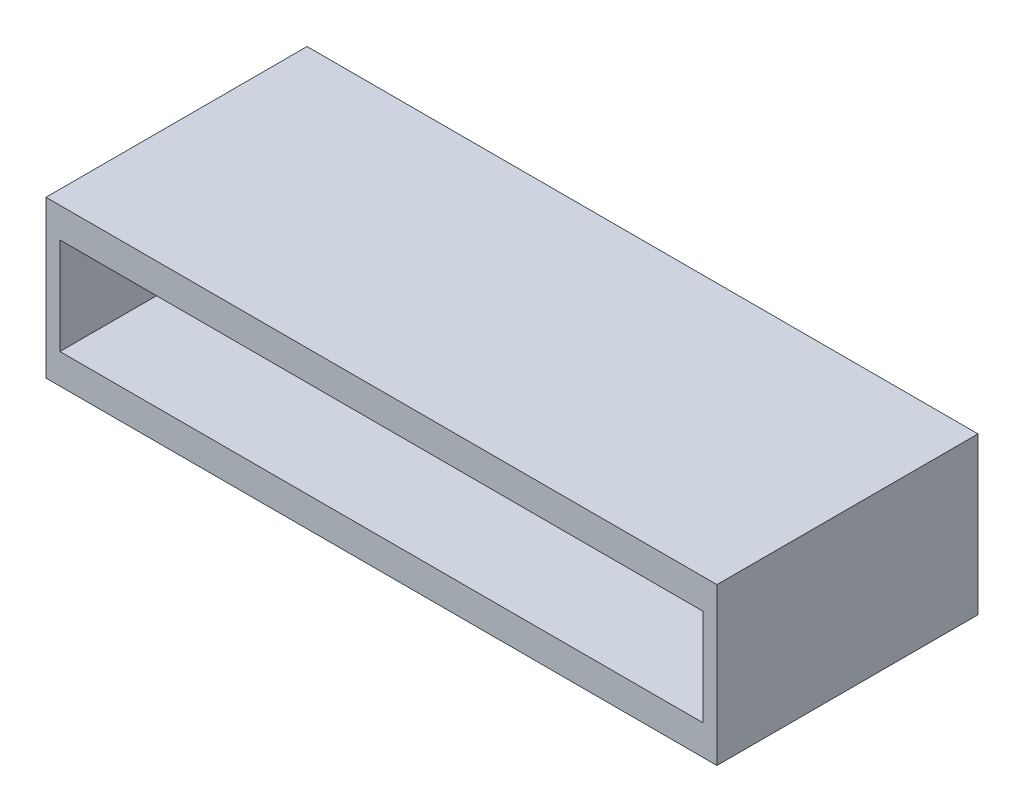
from build123d import *

# Parameters (mm, degrees)
SKETCH1_W           = 12.85
SKETCH1_H           = 5
BOSS_EXTRUDE1_DEPTH = 1.5
SKETCH3_W           = 12.31491511
SKETCH3_H           = 1.85
CUT_EXTRUDE1_DEPTH  = 3.5


with BuildPart() as part:
    # Sketch1 → Boss-Extrude1 (new, symmetric)
    with BuildSketch(Plane(origin=(0, 0, 0), x_dir=(1, 0, 0), z_dir=(0, 1, 0))):
        Rectangle(SKETCH1_W, SKETCH1_H)
    extrude(amount=BOSS_EXTRUDE1_DEPTH, both=True)

    # Sketch3 → Cut-Extrude1 (cut)
    with BuildSketch(Plane.XY.offset(2.5)):
        Rectangle(SKETCH3_W, SKETCH3_H)
    extrude(amount=-CUT_EXTRUDE1_DEPTH, mode=Mode.SUBTRACT)


solid = part.part
